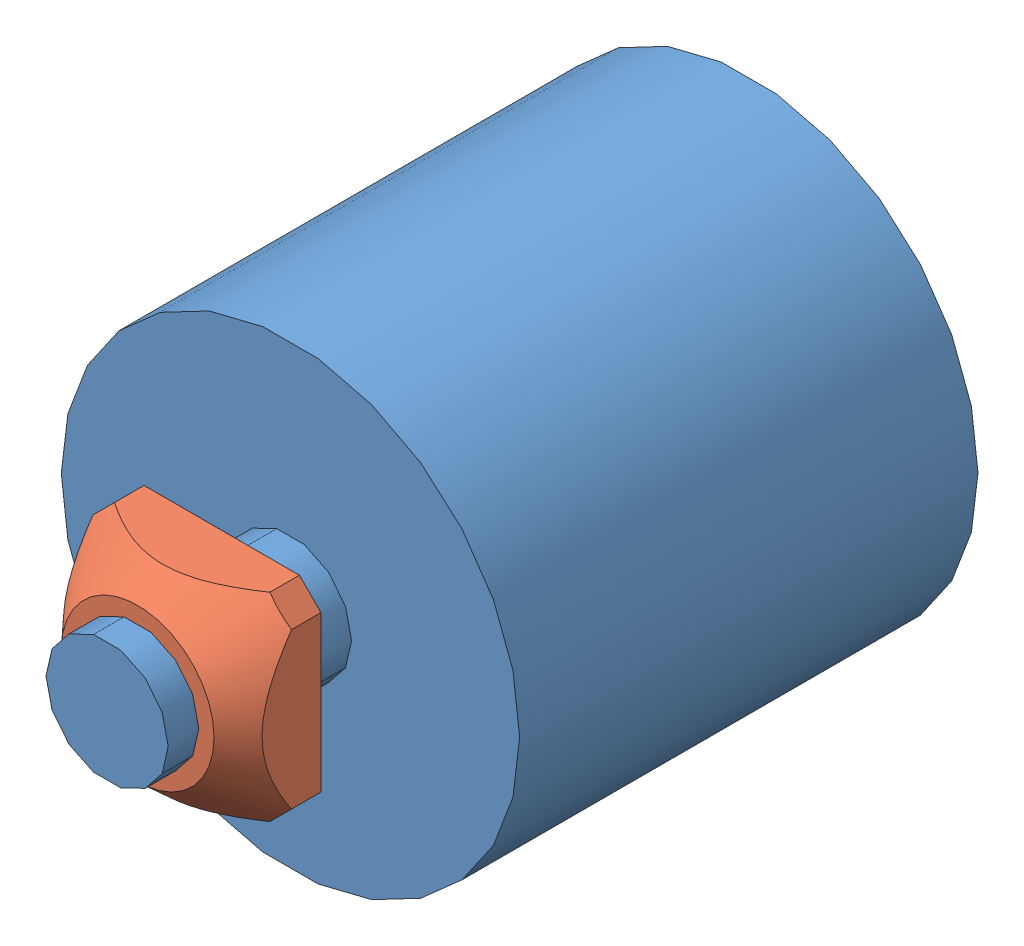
SolidWorks assembly 21.1759_1 STOPPER 30.SLDASM, configuration Default (file format 3800). Lengths in mm.
Overall size (30 30 42).
2 component instances, 2 part files, 3 mates.
Components (placement in the parent):
- 21.1759_1 STOPPER 30-1: 21.1759_1 STOPPER 30.SLDPRT [Default] at origin size (30 30 42)
- 21.1351 M8 SQUARE NUT-1: 21.1351 M8 SQUARE NUT.SLDPRT [Default] at (0 0 4.5) x (-1 0 0) z (0 0 -1) size (13 13 5.5)
Mates (geometry in assembly coordinates):
- Coincident1: coincident aligned: axis of ?; axis of 21.1759_1 STOPPER 30-1
- Distance1: distance = 4.5 mm anti-aligned: plane of 21.1759_1 STOPPER 30-1 through (0 0 0) normal (0 0 1); plane of 21.1351 M8 SQUARE NUT-1 through (0 0 4.5) normal (0 0 -1)
- Angle3: planar angle aligned: unknown of 21.1351 M8 SQUARE NUT-1
